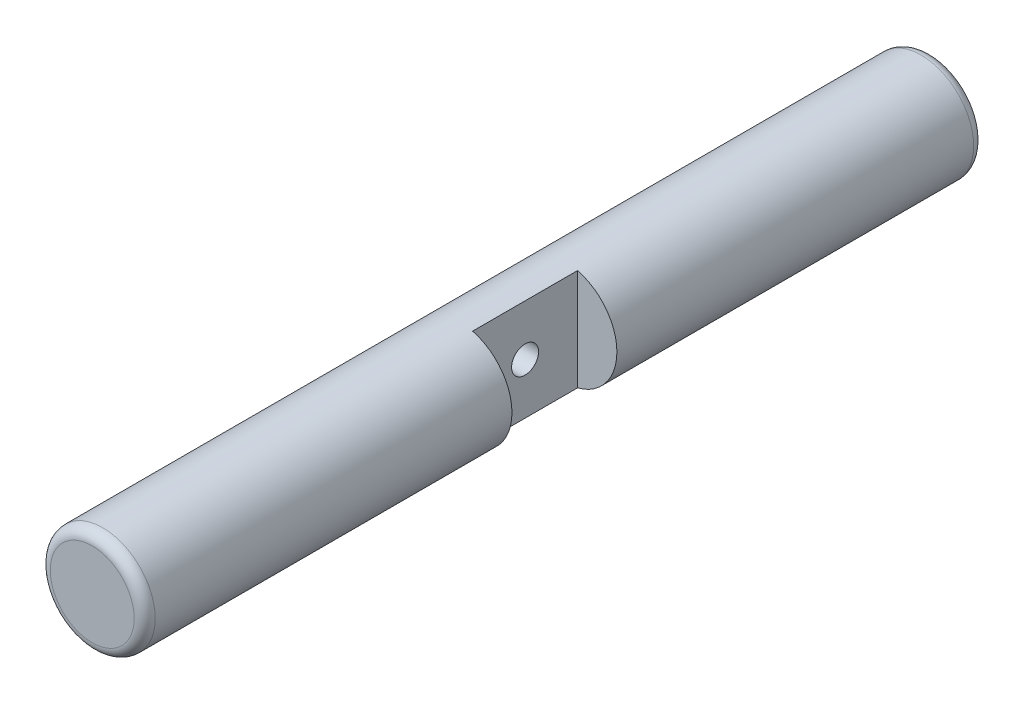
ISO-10303-21;
HEADER;
FILE_DESCRIPTION(('STEP AP214'),'2;1');
FILE_NAME('part.step','',(''),(''),'','','');
FILE_SCHEMA(('AUTOMOTIVE_DESIGN { 1 0 10303 214 1 1 1 1 }'));
ENDSEC;
DATA;
#1=APPLICATION_CONTEXT('core data for automotive mechanical design processes');
#2=APPLICATION_PROTOCOL_DEFINITION('international standard','automotive_design',2000,#1);
#3=PRODUCT_CONTEXT('',#1,'mechanical');
#4=PRODUCT('Part','Part','',(#3));
#5=PRODUCT_RELATED_PRODUCT_CATEGORY('part','',(#4));
#6=PRODUCT_DEFINITION_FORMATION('','',#4);
#7=PRODUCT_DEFINITION_CONTEXT('part definition',#1,'design');
#8=PRODUCT_DEFINITION('design','',#6,#7);
#9=PRODUCT_DEFINITION_SHAPE('','',#8);
#10=(LENGTH_UNIT() NAMED_UNIT(*) SI_UNIT(.MILLI.,.METRE.));
#11=(NAMED_UNIT(*) PLANE_ANGLE_UNIT() SI_UNIT($,.RADIAN.));
#12=(NAMED_UNIT(*) SI_UNIT($,.STERADIAN.) SOLID_ANGLE_UNIT());
#13=UNCERTAINTY_MEASURE_WITH_UNIT(LENGTH_MEASURE(1.E-05),#10,'distance_accuracy_value','');
#14=(GEOMETRIC_REPRESENTATION_CONTEXT(3) GLOBAL_UNCERTAINTY_ASSIGNED_CONTEXT((#13)) GLOBAL_UNIT_ASSIGNED_CONTEXT((#10,
#11,#12)) REPRESENTATION_CONTEXT('',''));
#15=CARTESIAN_POINT('',(0.,0.,0.));
#16=DIRECTION('',(0.,0.,1.));
#17=DIRECTION('',(1.,0.,0.));
#18=AXIS2_PLACEMENT_3D('',#15,#16,#17);
#19=CARTESIAN_POINT('',(0.,0.,101.6));
#20=DIRECTION('',(0.,0.,-1.));
#21=DIRECTION('',(-1.,0.,0.));
#22=AXIS2_PLACEMENT_3D('',#19,#20,#21);
#23=CYLINDRICAL_SURFACE('',#22,12.7);
#24=CARTESIAN_POINT('',(0.,0.,99.06));
#25=DIRECTION('',(0.,0.,1.));
#26=DIRECTION('',(1.,0.,0.));
#27=AXIS2_PLACEMENT_3D('',#24,#25,#26);
#28=CIRCLE('',#27,12.7);
#29=CARTESIAN_POINT('',(12.7,0.,99.06));
#30=VERTEX_POINT('',#29);
#31=EDGE_CURVE('E45',#30,#30,#28,.F.);
#32=ORIENTED_EDGE('',*,*,#31,.T.);
#33=EDGE_LOOP('',(#32));
#34=FACE_BOUND('',#33,.T.);
#35=CARTESIAN_POINT('',(0.,0.,-99.06));
#36=DIRECTION('',(0.,0.,1.));
#37=DIRECTION('',(1.,0.,0.));
#38=AXIS2_PLACEMENT_3D('',#35,#36,#37);
#39=CIRCLE('',#38,12.7);
#40=CARTESIAN_POINT('',(12.7,0.,-99.06));
#41=VERTEX_POINT('',#40);
#42=EDGE_CURVE('E128',#41,#41,#39,.T.);
#43=ORIENTED_EDGE('',*,*,#42,.T.);
#44=EDGE_LOOP('',(#43));
#45=FACE_BOUND('',#44,.T.);
#46=CARTESIAN_POINT('',(-11.8299873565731,-4.61967522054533,-4.97156660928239));
#47=CARTESIAN_POINT('',(-11.9069007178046,-4.42271004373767,-5.2458555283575));
#48=CARTESIAN_POINT('',(-11.9854415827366,-4.20713310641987,-5.50635049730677));
#49=CARTESIAN_POINT('',(-12.1396299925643,-3.73899309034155,-5.99275313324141));
#50=CARTESIAN_POINT('',(-12.2152793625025,-3.48645384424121,-6.21868289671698));
#51=CARTESIAN_POINT('',(-12.3486418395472,-2.97689546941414,-6.60344379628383));
#52=CARTESIAN_POINT('',(-12.4074176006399,-2.72379180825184,-6.7670177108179));
#53=CARTESIAN_POINT('',(-12.4859850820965,-2.3256293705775,-6.9811801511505));
#54=CARTESIAN_POINT('',(-12.5105811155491,-2.18977836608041,-7.04738382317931));
#55=CARTESIAN_POINT('',(-12.5559529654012,-1.91252211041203,-7.16843838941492));
#56=CARTESIAN_POINT('',(-12.5767305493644,-1.77111946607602,-7.22329453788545));
#57=CARTESIAN_POINT('',(-12.6140469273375,-1.48229900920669,-7.32116870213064));
#58=CARTESIAN_POINT('',(-12.6305465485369,-1.33483901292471,-7.36407756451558));
#59=CARTESIAN_POINT('',(-12.6585387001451,-1.03627197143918,-7.43655013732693));
#60=CARTESIAN_POINT('',(-12.6700337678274,-0.885166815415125,-7.46612061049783));
#61=CARTESIAN_POINT('',(-12.6876364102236,-0.580630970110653,-7.51129801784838));
#62=CARTESIAN_POINT('',(-12.6937463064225,-0.427201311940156,-7.52691096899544));
#63=CARTESIAN_POINT('',(-12.700370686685,-0.119444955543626,-7.54383549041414));
#64=CARTESIAN_POINT('',(-12.7008858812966,0.0348816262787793,-7.5451488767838));
#65=CARTESIAN_POINT('',(-12.6966052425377,0.322682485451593,-7.53421623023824));
#66=CARTESIAN_POINT('',(-12.6924972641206,0.456236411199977,-7.52372637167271));
#67=CARTESIAN_POINT('',(-12.6801649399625,0.721903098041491,-7.49213313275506));
#68=CARTESIAN_POINT('',(-12.6719393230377,0.854015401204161,-7.47102647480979));
#69=CARTESIAN_POINT('',(-12.6413768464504,1.24668847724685,-7.3922583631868));
#70=CARTESIAN_POINT('',(-12.6131498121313,1.50385068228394,-7.31913777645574));
#71=CARTESIAN_POINT('',(-12.543448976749,2.00407507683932,-7.13547614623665));
#72=CARTESIAN_POINT('',(-12.501892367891,2.24703759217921,-7.02470091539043));
#73=CARTESIAN_POINT('',(-12.4089946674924,2.71357801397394,-6.77114064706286));
#74=CARTESIAN_POINT('',(-12.3576473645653,2.93714348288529,-6.62833527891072));
#75=CARTESIAN_POINT('',(-12.2245757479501,3.45689636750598,-6.24671141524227));
#76=CARTESIAN_POINT('',(-12.1394500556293,3.74155731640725,-5.99334176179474));
#77=CARTESIAN_POINT('',(-11.9658692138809,4.26428953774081,-5.44331068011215));
#78=CARTESIAN_POINT('',(-11.8774087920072,4.5022829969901,-5.14657836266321));
#79=CARTESIAN_POINT('',(-11.7046176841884,4.93424374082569,-4.51513242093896));
#80=CARTESIAN_POINT('',(-11.620364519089,5.12752991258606,-4.17993467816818));
#81=CARTESIAN_POINT('',(-11.46535262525,5.46537638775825,-3.48294353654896));
#82=CARTESIAN_POINT('',(-11.3945912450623,5.60994626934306,-3.12115538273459));
#83=CARTESIAN_POINT('',(-11.298905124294,5.79919750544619,-2.53464307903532));
#84=CARTESIAN_POINT('',(-11.2672107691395,5.86033075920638,-2.31616493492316));
#85=CARTESIAN_POINT('',(-11.2117348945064,5.96578448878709,-1.87413326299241));
#86=CARTESIAN_POINT('',(-11.1879540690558,6.01010349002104,-1.65057929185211));
#87=CARTESIAN_POINT('',(-11.1491935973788,6.08170506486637,-1.200018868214));
#88=CARTESIAN_POINT('',(-11.1342137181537,6.10898808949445,-0.973012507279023));
#89=CARTESIAN_POINT('',(-11.1136175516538,6.14637823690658,-0.517169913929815));
#90=CARTESIAN_POINT('',(-11.1080008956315,6.15648603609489,-0.28833375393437));
#91=CARTESIAN_POINT('',(-11.1063530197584,6.15945810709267,0.16806198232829));
#92=CARTESIAN_POINT('',(-11.1102624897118,6.15242907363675,0.395620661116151));
#93=CARTESIAN_POINT('',(-11.1273930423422,6.12139170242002,0.849224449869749));
#94=CARTESIAN_POINT('',(-11.1406142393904,6.09738315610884,1.07526954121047));
#95=CARTESIAN_POINT('',(-11.1758796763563,6.03250139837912,1.52432106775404));
#96=CARTESIAN_POINT('',(-11.1979275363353,5.99162126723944,1.74732621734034));
#97=CARTESIAN_POINT('',(-11.2500419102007,5.89318700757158,2.18865797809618));
#98=CARTESIAN_POINT('',(-11.2801084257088,5.83563287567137,2.40698458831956));
#99=CARTESIAN_POINT('',(-11.3471218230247,5.7042306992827,2.83689840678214));
#100=CARTESIAN_POINT('',(-11.3840481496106,5.63043121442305,3.04850359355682));
#101=CARTESIAN_POINT('',(-11.4635995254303,5.46664027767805,3.46424205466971));
#102=CARTESIAN_POINT('',(-11.5062269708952,5.37664201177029,3.66837214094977));
#103=CARTESIAN_POINT('',(-11.6406676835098,5.08247175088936,4.26744748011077));
#104=CARTESIAN_POINT('',(-11.7391251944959,4.85396766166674,4.64959577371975));
#105=CARTESIAN_POINT('',(-11.8822124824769,4.48514557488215,5.1567930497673));
#106=CARTESIAN_POINT('',(-11.9248177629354,4.37090986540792,5.30202387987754));
#107=CARTESIAN_POINT('',(-12.009925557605,4.13132879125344,5.58303329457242));
#108=CARTESIAN_POINT('',(-12.0524280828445,4.00598467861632,5.71881294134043));
#109=CARTESIAN_POINT('',(-12.1781228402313,3.6136676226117,6.10976857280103));
#110=CARTESIAN_POINT('',(-12.2596991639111,3.32992578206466,6.34923756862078));
#111=CARTESIAN_POINT('',(-12.3935933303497,2.78395341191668,6.72912974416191));
#112=CARTESIAN_POINT('',(-12.4484681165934,2.52951405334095,6.879794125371));
#113=CARTESIAN_POINT('',(-12.5206879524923,2.13088707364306,7.07451371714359));
#114=CARTESIAN_POINT('',(-12.5430832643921,1.99514940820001,7.13421780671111));
#115=CARTESIAN_POINT('',(-12.5839407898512,1.71869795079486,7.2423117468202));
#116=CARTESIAN_POINT('',(-12.6024047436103,1.57798639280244,7.29070660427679));
#117=CARTESIAN_POINT('',(-12.635012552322,1.29129393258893,7.37570144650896));
#118=CARTESIAN_POINT('',(-12.6491203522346,1.145279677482,7.41220312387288));
#119=CARTESIAN_POINT('',(-12.6723685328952,0.850265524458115,7.47214376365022));
#120=CARTESIAN_POINT('',(-12.681511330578,0.701267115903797,7.49558908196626));
#121=CARTESIAN_POINT('',(-12.6945356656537,0.401565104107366,7.52893935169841));
#122=CARTESIAN_POINT('',(-12.698418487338,0.250861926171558,7.53884760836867));
#123=CARTESIAN_POINT('',(-12.7007940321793,-0.0508534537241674,7.54491306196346));
#124=CARTESIAN_POINT('',(-12.6992873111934,-0.201865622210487,7.54107167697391));
#125=CARTESIAN_POINT('',(-12.6914393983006,-0.484664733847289,7.52101135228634));
#126=CARTESIAN_POINT('',(-12.6857012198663,-0.616580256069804,7.50633605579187));
#127=CARTESIAN_POINT('',(-12.6702517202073,-0.878628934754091,7.46667480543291));
#128=CARTESIAN_POINT('',(-12.6605391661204,-1.00876152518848,7.44168565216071));
#129=CARTESIAN_POINT('',(-12.6257811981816,-1.3950789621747,7.35180780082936));
#130=CARTESIAN_POINT('',(-12.5951078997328,-1.64743269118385,7.27199004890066));
#131=CARTESIAN_POINT('',(-12.5206090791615,-2.14213349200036,7.07460211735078));
#132=CARTESIAN_POINT('',(-12.4764683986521,-2.38406184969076,6.9561219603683));
#133=CARTESIAN_POINT('',(-12.3789038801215,-2.84761751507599,6.68755139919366));
#134=CARTESIAN_POINT('',(-12.3254737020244,-3.06923079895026,6.53743939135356));
#135=CARTESIAN_POINT('',(-12.187337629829,-3.5859853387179,6.13649331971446));
#136=CARTESIAN_POINT('',(-12.0994446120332,-3.86883590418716,5.87087035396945));
#137=CARTESIAN_POINT('',(-11.921723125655,-4.38607181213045,5.29649312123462));
#138=CARTESIAN_POINT('',(-11.8318916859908,-4.62037590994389,4.98766797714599));
#139=CARTESIAN_POINT('',(-11.6580980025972,-5.04297717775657,4.33229223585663));
#140=CARTESIAN_POINT('',(-11.5742340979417,-5.23059334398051,3.98527901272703));
#141=CARTESIAN_POINT('',(-11.4220120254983,-5.55516875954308,3.26517379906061));
#142=CARTESIAN_POINT('',(-11.3536494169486,-5.69214252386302,2.89208931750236));
#143=CARTESIAN_POINT('',(-11.2638615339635,-5.86689072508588,2.29151649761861));
#144=CARTESIAN_POINT('',(-11.2348686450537,-5.92203320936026,2.07003552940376));
#145=CARTESIAN_POINT('',(-11.1852241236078,-6.01527973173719,1.62252661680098));
#146=CARTESIAN_POINT('',(-11.1645731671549,-6.05338238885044,1.39649830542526));
#147=CARTESIAN_POINT('',(-11.1324036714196,-6.11234092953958,0.941556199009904));
#148=CARTESIAN_POINT('',(-11.1208855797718,-6.13319596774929,0.712642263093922));
#149=CARTESIAN_POINT('',(-11.1074237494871,-6.15754299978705,0.253616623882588));
#150=CARTESIAN_POINT('',(-11.1054795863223,-6.16103576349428,0.0235049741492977));
#151=CARTESIAN_POINT('',(-11.1112023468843,-6.15070838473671,-0.433094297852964));
#152=CARTESIAN_POINT('',(-11.118739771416,-6.13712151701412,-0.659588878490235));
#153=CARTESIAN_POINT('',(-11.1429188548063,-6.09310968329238,-1.11044619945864));
#154=CARTESIAN_POINT('',(-11.1595607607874,-6.06268426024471,-1.33480888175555));
#155=CARTESIAN_POINT('',(-11.2013415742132,-5.985139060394,-1.77986532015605));
#156=CARTESIAN_POINT('',(-11.2264816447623,-5.93801699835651,-2.00055856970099));
#157=CARTESIAN_POINT('',(-11.2843457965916,-5.82729846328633,-2.43668840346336));
#158=CARTESIAN_POINT('',(-11.3170693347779,-5.76370316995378,-2.65212536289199));
#159=CARTESIAN_POINT('',(-11.4170464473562,-5.56431779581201,-3.24163825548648));
#160=CARTESIAN_POINT('',(-11.4913568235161,-5.41085425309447,-3.60872903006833));
#161=CARTESIAN_POINT('',(-11.65304248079,-5.05321670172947,-4.31396236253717));
#162=CARTESIAN_POINT('',(-11.7404111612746,-4.84906827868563,-4.65211941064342));
#163=CARTESIAN_POINT('',(-11.8299873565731,-4.61967522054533,-4.97156660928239));
#164=B_SPLINE_CURVE_WITH_KNOTS('',3,(#46,#47,#48,#49,#50,#51,#52,#53,#54,#55,#56,#57,#58,#59,
#60,#61,#62,#63,#64,#65,#66,#67,#68,#69,#70,#71,#72,#73,#74,#75,#76,#77,#78,#79,#80,#81,#82,#83,
#84,#85,#86,#87,#88,#89,#90,#91,#92,#93,#94,#95,#96,#97,#98,#99,#100,#101,#102,#103,#104,#105,
#106,#107,#108,#109,#110,#111,#112,#113,#114,#115,#116,#117,#118,#119,#120,#121,#122,#123,#124,
#125,#126,#127,#128,#129,#130,#131,#132,#133,#134,#135,#136,#137,#138,#139,#140,#141,#142,#143,
#144,#145,#146,#147,#148,#149,#150,#151,#152,#153,#154,#155,#156,#157,#158,#159,#160,#161,#162,
#163),.UNSPECIFIED.,.T.,.F.,(4,2,2,2,2,2,2,2,2,2,2,2,2,2,2,2,2,2,2,2,2,2,2,2,2,2,2,2,2,2,2,2,2,
2,2,2,2,2,2,2,2,2,2,2,2,2,2,2,2,2,2,2,2,2,2,2,2,2,4),(0.,1.03811233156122,2.07555823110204,
2.99269934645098,3.45155900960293,3.91020572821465,4.3729146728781,4.83538875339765,
5.29766336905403,5.75987927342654,6.16145992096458,6.56316461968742,7.36578770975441,
8.17349680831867,8.98172004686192,10.1468461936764,11.313898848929,12.497706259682,
13.6812807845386,14.3678004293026,15.054380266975,15.7409419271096,16.4274765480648,
17.1097476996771,17.7920272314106,18.4745868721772,19.1571466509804,19.8376932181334,
20.5185267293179,21.8785683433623,22.4470139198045,23.0153955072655,24.1496222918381,
25.0480507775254,25.4974770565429,25.9467039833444,26.3995551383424,26.8521856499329,
27.3047056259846,27.7571789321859,28.1552526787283,28.5534500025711,29.3491039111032,
30.1650279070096,30.9815109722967,32.1686411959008,33.3577423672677,34.5632868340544,
35.768485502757,36.4580019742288,37.1475743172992,37.8371804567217,38.5267560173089,
39.2070148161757,39.887292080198,40.5676624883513,41.2479841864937,42.4576182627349,
43.6666429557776),.UNSPECIFIED.);
#165=CARTESIAN_POINT('',(-11.8299873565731,-4.61967522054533,-4.97156660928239));
#166=VERTEX_POINT('',#165);
#167=EDGE_CURVE('E76',#166,#166,#164,.T.);
#168=ORIENTED_EDGE('',*,*,#167,.T.);
#169=EDGE_LOOP('',(#168));
#170=FACE_BOUND('',#169,.T.);
#171=DIRECTION('',(0.,0.,1.));
#172=VECTOR('',#171,1.);
#173=CARTESIAN_POINT('',(3.175,12.2967221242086,-12.7));
#174=LINE('',#173,#172);
#175=CARTESIAN_POINT('',(3.175,12.2967221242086,-12.7));
#176=VERTEX_POINT('',#175);
#177=CARTESIAN_POINT('',(3.175,12.2967221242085,12.7));
#178=VERTEX_POINT('',#177);
#179=EDGE_CURVE('E72',#176,#178,#174,.T.);
#180=ORIENTED_EDGE('',*,*,#179,.F.);
#181=CARTESIAN_POINT('',(0.,0.,-12.7));
#182=DIRECTION('',(0.,0.,1.));
#183=DIRECTION('',(-1.,0.,0.));
#184=AXIS2_PLACEMENT_3D('',#181,#182,#183);
#185=CIRCLE('',#184,12.7);
#186=CARTESIAN_POINT('',(3.175,-12.2967221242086,-12.7));
#187=VERTEX_POINT('',#186);
#188=EDGE_CURVE('E73',#187,#176,#185,.T.);
#189=ORIENTED_EDGE('',*,*,#188,.F.);
#190=DIRECTION('',(0.,0.,1.));
#191=VECTOR('',#190,1.);
#192=CARTESIAN_POINT('',(3.175,-12.2967221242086,-12.7));
#193=LINE('',#192,#191);
#194=CARTESIAN_POINT('',(3.175,-12.2967221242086,12.7));
#195=VERTEX_POINT('',#194);
#196=EDGE_CURVE('E59',#187,#195,#193,.T.);
#197=ORIENTED_EDGE('',*,*,#196,.T.);
#198=CARTESIAN_POINT('',(0.,0.,12.7));
#199=DIRECTION('',(0.,0.,1.));
#200=DIRECTION('',(-1.,0.,0.));
#201=AXIS2_PLACEMENT_3D('',#198,#199,#200);
#202=CIRCLE('',#201,12.7);
#203=EDGE_CURVE('E65',#195,#178,#202,.T.);
#204=ORIENTED_EDGE('',*,*,#203,.T.);
#205=EDGE_LOOP('',(#180,#189,#197,#204));
#206=FACE_BOUND('',#205,.T.);
#207=ADVANCED_FACE('F37',(#34,#45,#170,#206),#23,.T.);
#208=CARTESIAN_POINT('',(0.,0.,101.6));
#209=DIRECTION('',(0.,0.,1.));
#210=DIRECTION('',(1.,0.,0.));
#211=AXIS2_PLACEMENT_3D('',#208,#209,#210);
#212=PLANE('',#211);
#213=CARTESIAN_POINT('',(0.,0.,101.6));
#214=DIRECTION('',(0.,0.,1.));
#215=DIRECTION('',(1.,0.,0.));
#216=AXIS2_PLACEMENT_3D('',#213,#214,#215);
#217=CIRCLE('',#216,10.16);
#218=CARTESIAN_POINT('',(10.16,0.,101.6));
#219=VERTEX_POINT('',#218);
#220=EDGE_CURVE('E79',#219,#219,#217,.T.);
#221=ORIENTED_EDGE('',*,*,#220,.T.);
#222=EDGE_LOOP('',(#221));
#223=FACE_BOUND('',#222,.T.);
#224=ADVANCED_FACE('F111',(#223),#212,.T.);
#225=CARTESIAN_POINT('',(0.,0.,-101.6));
#226=DIRECTION('',(0.,0.,1.));
#227=DIRECTION('',(1.,0.,0.));
#228=AXIS2_PLACEMENT_3D('',#225,#226,#227);
#229=PLANE('',#228);
#230=CARTESIAN_POINT('',(0.,0.,-101.6));
#231=DIRECTION('',(0.,0.,1.));
#232=DIRECTION('',(1.,0.,0.));
#233=AXIS2_PLACEMENT_3D('',#230,#231,#232);
#234=CIRCLE('',#233,10.16);
#235=CARTESIAN_POINT('',(10.16,0.,-101.6));
#236=VERTEX_POINT('',#235);
#237=EDGE_CURVE('E11',#236,#236,#234,.F.);
#238=ORIENTED_EDGE('',*,*,#237,.T.);
#239=EDGE_LOOP('',(#238));
#240=FACE_BOUND('',#239,.T.);
#241=ADVANCED_FACE('F109',(#240),#229,.F.);
#242=CARTESIAN_POINT('',(3.175,12.2967221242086,-12.7));
#243=DIRECTION('',(-1.,0.,0.));
#244=DIRECTION('',(0.,0.,1.));
#245=AXIS2_PLACEMENT_3D('',#242,#243,#244);
#246=PLANE('',#245);
#247=CARTESIAN_POINT('',(3.175,0.,0.));
#248=DIRECTION('',(-1.,0.,0.));
#249=DIRECTION('',(0.,0.,1.));
#250=AXIS2_PLACEMENT_3D('',#247,#248,#249);
#251=CIRCLE('',#250,3.26389999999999);
#252=CARTESIAN_POINT('',(3.175,0.,3.26389999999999));
#253=VERTEX_POINT('',#252);
#254=EDGE_CURVE('E69',#253,#253,#251,.T.);
#255=ORIENTED_EDGE('',*,*,#254,.T.);
#256=EDGE_LOOP('',(#255));
#257=FACE_BOUND('',#256,.T.);
#258=DIRECTION('',(0.,-1.,0.));
#259=VECTOR('',#258,1.);
#260=CARTESIAN_POINT('',(3.175,12.2967221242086,12.7));
#261=LINE('',#260,#259);
#262=EDGE_CURVE('E51',#178,#195,#261,.T.);
#263=ORIENTED_EDGE('',*,*,#262,.T.);
#264=ORIENTED_EDGE('',*,*,#196,.F.);
#265=DIRECTION('',(0.,-1.,0.));
#266=VECTOR('',#265,1.);
#267=CARTESIAN_POINT('',(3.175,12.2967221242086,-12.7));
#268=LINE('',#267,#266);
#269=EDGE_CURVE('E81',#176,#187,#268,.T.);
#270=ORIENTED_EDGE('',*,*,#269,.F.);
#271=ORIENTED_EDGE('',*,*,#179,.T.);
#272=EDGE_LOOP('',(#263,#264,#270,#271));
#273=FACE_BOUND('',#272,.T.);
#274=ADVANCED_FACE('F71',(#257,#273),#246,.F.);
#275=CARTESIAN_POINT('',(0.,0.,-12.7));
#276=DIRECTION('',(0.,0.,-1.));
#277=DIRECTION('',(-1.,0.,0.));
#278=AXIS2_PLACEMENT_3D('',#275,#276,#277);
#279=PLANE('',#278);
#280=ORIENTED_EDGE('',*,*,#188,.T.);
#281=ORIENTED_EDGE('',*,*,#269,.T.);
#282=EDGE_LOOP('',(#280,#281));
#283=FACE_BOUND('',#282,.T.);
#284=ADVANCED_FACE('F101',(#283),#279,.F.);
#285=CARTESIAN_POINT('',(0.,0.,12.7));
#286=DIRECTION('',(0.,0.,-1.));
#287=DIRECTION('',(-1.,0.,0.));
#288=AXIS2_PLACEMENT_3D('',#285,#286,#287);
#289=PLANE('',#288);
#290=ORIENTED_EDGE('',*,*,#203,.F.);
#291=ORIENTED_EDGE('',*,*,#262,.F.);
#292=EDGE_LOOP('',(#290,#291));
#293=FACE_BOUND('',#292,.T.);
#294=ADVANCED_FACE('F66',(#293),#289,.T.);
#295=CARTESIAN_POINT('',(-12.7,0.,0.));
#296=DIRECTION('',(-1.,0.,0.));
#297=DIRECTION('',(0.,0.,1.));
#298=AXIS2_PLACEMENT_3D('',#295,#296,#297);
#299=CYLINDRICAL_SURFACE('',#298,3.26389999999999);
#300=CARTESIAN_POINT('',(-7.77759015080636,0.,0.));
#301=DIRECTION('',(-1.,0.,0.));
#302=DIRECTION('',(0.,0.,1.));
#303=AXIS2_PLACEMENT_3D('',#300,#301,#302);
#304=CIRCLE('',#303,3.2639);
#305=CARTESIAN_POINT('',(-7.77759015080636,0.,3.2639));
#306=VERTEX_POINT('',#305);
#307=EDGE_CURVE('E222',#306,#306,#304,.T.);
#308=ORIENTED_EDGE('',*,*,#307,.T.);
#309=EDGE_LOOP('',(#308));
#310=FACE_BOUND('',#309,.T.);
#311=ORIENTED_EDGE('',*,*,#254,.F.);
#312=EDGE_LOOP('',(#311));
#313=FACE_BOUND('',#312,.T.);
#314=ADVANCED_FACE('F96',(#310,#313),#299,.F.);
#315=CARTESIAN_POINT('',(-12.7,0.,0.));
#316=DIRECTION('',(-1.,0.,0.));
#317=DIRECTION('',(0.,0.,1.));
#318=AXIS2_PLACEMENT_3D('',#315,#316,#317);
#319=CONICAL_SURFACE('',#318,7.5428856,0.715584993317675);
#320=ORIENTED_EDGE('',*,*,#307,.F.);
#321=EDGE_LOOP('',(#320));
#322=FACE_BOUND('',#321,.T.);
#323=ORIENTED_EDGE('',*,*,#167,.F.);
#324=EDGE_LOOP('',(#323));
#325=FACE_BOUND('',#324,.T.);
#326=ADVANCED_FACE('F91',(#322,#325),#319,.F.);
#327=CARTESIAN_POINT('',(0.,0.,99.06));
#328=DIRECTION('',(0.,0.,1.));
#329=DIRECTION('',(1.,0.,0.));
#330=AXIS2_PLACEMENT_3D('',#327,#328,#329);
#331=TOROIDAL_SURFACE('',#330,10.16,2.54);
#332=ORIENTED_EDGE('',*,*,#31,.F.);
#333=EDGE_LOOP('',(#332));
#334=FACE_BOUND('',#333,.T.);
#335=ORIENTED_EDGE('',*,*,#220,.F.);
#336=EDGE_LOOP('',(#335));
#337=FACE_BOUND('',#336,.T.);
#338=ADVANCED_FACE('F95',(#334,#337),#331,.T.);
#339=CARTESIAN_POINT('',(0.,0.,-99.06));
#340=DIRECTION('',(0.,0.,1.));
#341=DIRECTION('',(1.,0.,0.));
#342=AXIS2_PLACEMENT_3D('',#339,#340,#341);
#343=TOROIDAL_SURFACE('',#342,10.16,2.54);
#344=ORIENTED_EDGE('',*,*,#237,.F.);
#345=EDGE_LOOP('',(#344));
#346=FACE_BOUND('',#345,.T.);
#347=ORIENTED_EDGE('',*,*,#42,.F.);
#348=EDGE_LOOP('',(#347));
#349=FACE_BOUND('',#348,.T.);
#350=ADVANCED_FACE('F39',(#346,#349),#343,.T.);
#351=CLOSED_SHELL('',(#207,#224,#241,#274,#284,#294,#314,#326,#338,#350));
#352=MANIFOLD_SOLID_BREP('B2',#351);
#353=ADVANCED_BREP_SHAPE_REPRESENTATION('',(#18,#352),#14);
#354=SHAPE_DEFINITION_REPRESENTATION(#9,#353);
ENDSEC;
END-ISO-10303-21;
